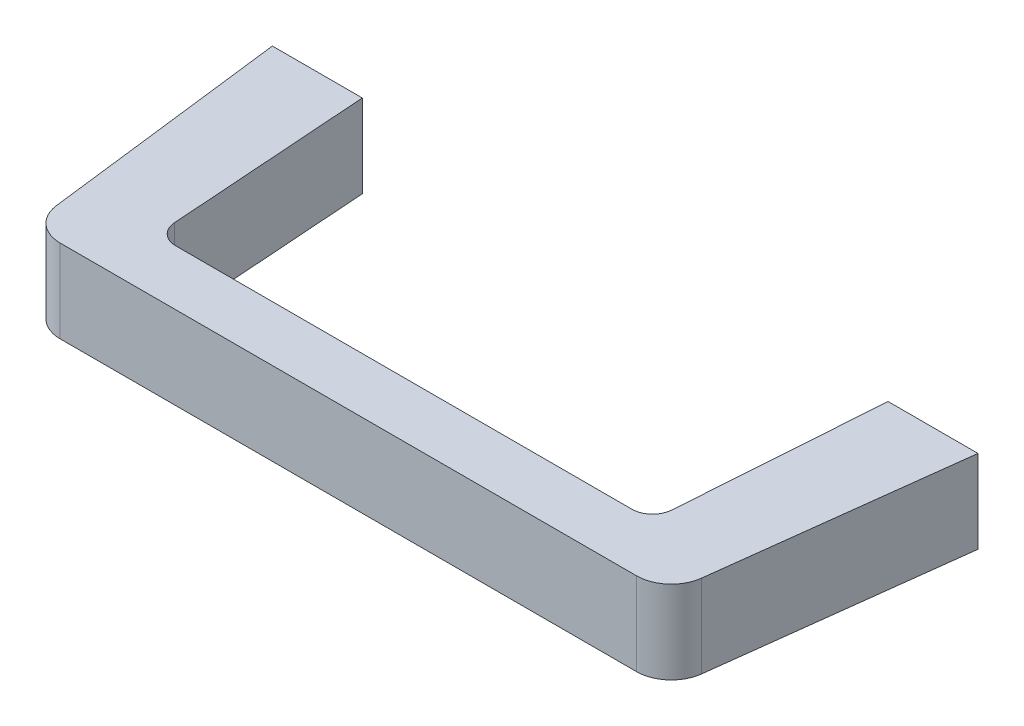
ISO-10303-21;
HEADER;
FILE_DESCRIPTION(('STEP AP214'),'2;1');
FILE_NAME('part.step','',(''),(''),'','','');
FILE_SCHEMA(('AUTOMOTIVE_DESIGN { 1 0 10303 214 1 1 1 1 }'));
ENDSEC;
DATA;
#1=APPLICATION_CONTEXT('core data for automotive mechanical design processes');
#2=APPLICATION_PROTOCOL_DEFINITION('international standard','automotive_design',2000,#1);
#3=PRODUCT_CONTEXT('',#1,'mechanical');
#4=PRODUCT('Part','Part','',(#3));
#5=PRODUCT_RELATED_PRODUCT_CATEGORY('part','',(#4));
#6=PRODUCT_DEFINITION_FORMATION('','',#4);
#7=PRODUCT_DEFINITION_CONTEXT('part definition',#1,'design');
#8=PRODUCT_DEFINITION('design','',#6,#7);
#9=PRODUCT_DEFINITION_SHAPE('','',#8);
#10=(LENGTH_UNIT() NAMED_UNIT(*) SI_UNIT(.MILLI.,.METRE.));
#11=(NAMED_UNIT(*) PLANE_ANGLE_UNIT() SI_UNIT($,.RADIAN.));
#12=(NAMED_UNIT(*) SI_UNIT($,.STERADIAN.) SOLID_ANGLE_UNIT());
#13=UNCERTAINTY_MEASURE_WITH_UNIT(LENGTH_MEASURE(1.E-05),#10,'distance_accuracy_value','');
#14=(GEOMETRIC_REPRESENTATION_CONTEXT(3) GLOBAL_UNCERTAINTY_ASSIGNED_CONTEXT((#13)) GLOBAL_UNIT_ASSIGNED_CONTEXT((#10,
#11,#12)) REPRESENTATION_CONTEXT('',''));
#15=CARTESIAN_POINT('',(0.,0.,0.));
#16=DIRECTION('',(0.,0.,1.));
#17=DIRECTION('',(1.,0.,0.));
#18=AXIS2_PLACEMENT_3D('',#15,#16,#17);
#19=CARTESIAN_POINT('',(-7.,-6.,0.));
#20=DIRECTION('',(0.,0.,1.));
#21=DIRECTION('',(0.,-1.,0.));
#22=AXIS2_PLACEMENT_3D('',#19,#20,#21);
#23=PLANE('',#22);
#24=DIRECTION('',(0.,1.,0.));
#25=VECTOR('',#24,1.);
#26=CARTESIAN_POINT('',(6.,-6.,0.));
#27=LINE('',#26,#25);
#28=CARTESIAN_POINT('',(6.,-6.,0.));
#29=VERTEX_POINT('',#28);
#30=CARTESIAN_POINT('',(6.,6.,0.));
#31=VERTEX_POINT('',#30);
#32=EDGE_CURVE('E196',#29,#31,#27,.T.);
#33=ORIENTED_EDGE('',*,*,#32,.F.);
#34=DIRECTION('',(1.,0.,0.));
#35=VECTOR('',#34,1.);
#36=CARTESIAN_POINT('',(-7.,-6.,0.));
#37=LINE('',#36,#35);
#38=CARTESIAN_POINT('',(-7.,-6.,0.));
#39=VERTEX_POINT('',#38);
#40=EDGE_CURVE('E162',#39,#29,#37,.T.);
#41=ORIENTED_EDGE('',*,*,#40,.F.);
#42=DIRECTION('',(0.,1.,0.));
#43=VECTOR('',#42,1.);
#44=CARTESIAN_POINT('',(-7.,-6.,0.));
#45=LINE('',#44,#43);
#46=CARTESIAN_POINT('',(-7.,6.,0.));
#47=VERTEX_POINT('',#46);
#48=EDGE_CURVE('E198',#39,#47,#45,.T.);
#49=ORIENTED_EDGE('',*,*,#48,.T.);
#50=DIRECTION('',(1.,0.,0.));
#51=VECTOR('',#50,1.);
#52=CARTESIAN_POINT('',(-7.,6.,0.));
#53=LINE('',#52,#51);
#54=EDGE_CURVE('E130',#47,#31,#53,.T.);
#55=ORIENTED_EDGE('',*,*,#54,.T.);
#56=EDGE_LOOP('',(#33,#41,#49,#55));
#57=FACE_BOUND('',#56,.T.);
#58=CARTESIAN_POINT('',(0.,0.,0.));
#59=DIRECTION('',(0.,0.,1.));
#60=DIRECTION('',(0.,-1.,0.));
#61=AXIS2_PLACEMENT_3D('',#58,#59,#60);
#62=CIRCLE('',#61,2.5);
#63=CARTESIAN_POINT('',(0.,-2.5,0.));
#64=VERTEX_POINT('',#63);
#65=EDGE_CURVE('E292',#64,#64,#62,.T.);
#66=ORIENTED_EDGE('',*,*,#65,.T.);
#67=EDGE_LOOP('',(#66));
#68=FACE_BOUND('',#67,.T.);
#69=ADVANCED_FACE('F14',(#57,#68),#23,.F.);
#70=CARTESIAN_POINT('',(85.664991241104,-6.,35.));
#71=DIRECTION('',(0.,1.,0.));
#72=DIRECTION('',(-1.,0.,0.));
#73=AXIS2_PLACEMENT_3D('',#70,#71,#72);
#74=CYLINDRICAL_SURFACE('',#73,5.);
#75=DIRECTION('',(0.,1.,0.));
#76=VECTOR('',#75,1.);
#77=CARTESIAN_POINT('',(85.664991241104,-6.,40.));
#78=LINE('',#77,#76);
#79=CARTESIAN_POINT('',(85.664991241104,-6.,40.));
#80=VERTEX_POINT('',#79);
#81=CARTESIAN_POINT('',(85.664991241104,6.,40.));
#82=VERTEX_POINT('',#81);
#83=EDGE_CURVE('E9',#80,#82,#78,.T.);
#84=ORIENTED_EDGE('',*,*,#83,.F.);
#85=CARTESIAN_POINT('',(85.664991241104,-6.,35.));
#86=DIRECTION('',(0.,-1.,0.));
#87=DIRECTION('',(1.,0.,0.));
#88=AXIS2_PLACEMENT_3D('',#85,#86,#87);
#89=CIRCLE('',#88,5.);
#90=CARTESIAN_POINT('',(90.627721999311,-6.,35.6093467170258));
#91=VERTEX_POINT('',#90);
#92=EDGE_CURVE('E153',#91,#80,#89,.T.);
#93=ORIENTED_EDGE('',*,*,#92,.F.);
#94=DIRECTION('',(0.,1.,0.));
#95=VECTOR('',#94,1.);
#96=CARTESIAN_POINT('',(90.627721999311,-6.,35.6093467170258));
#97=LINE('',#96,#95);
#98=CARTESIAN_POINT('',(90.627721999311,6.,35.6093467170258));
#99=VERTEX_POINT('',#98);
#100=EDGE_CURVE('E29',#91,#99,#97,.T.);
#101=ORIENTED_EDGE('',*,*,#100,.T.);
#102=CARTESIAN_POINT('',(85.664991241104,6.,35.));
#103=DIRECTION('',(0.,-1.,0.));
#104=DIRECTION('',(1.,0.,0.));
#105=AXIS2_PLACEMENT_3D('',#102,#103,#104);
#106=CIRCLE('',#105,5.);
#107=EDGE_CURVE('E113',#99,#82,#106,.T.);
#108=ORIENTED_EDGE('',*,*,#107,.T.);
#109=EDGE_LOOP('',(#84,#93,#101,#108));
#110=FACE_BOUND('',#109,.T.);
#111=ADVANCED_FACE('F114',(#110),#74,.T.);
#112=CARTESIAN_POINT('',(85.664991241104,-6.,40.));
#113=DIRECTION('',(0.,0.,-1.));
#114=DIRECTION('',(1.,0.,0.));
#115=AXIS2_PLACEMENT_3D('',#112,#113,#114);
#116=PLANE('',#115);
#117=DIRECTION('',(0.,1.,0.));
#118=VECTOR('',#117,1.);
#119=CARTESIAN_POINT('',(2.33500875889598,-6.,40.));
#120=LINE('',#119,#118);
#121=CARTESIAN_POINT('',(2.33500875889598,-6.,40.));
#122=VERTEX_POINT('',#121);
#123=CARTESIAN_POINT('',(2.33500875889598,6.,40.));
#124=VERTEX_POINT('',#123);
#125=EDGE_CURVE('E22',#122,#124,#120,.T.);
#126=ORIENTED_EDGE('',*,*,#125,.F.);
#127=DIRECTION('',(-1.,0.,0.));
#128=VECTOR('',#127,1.);
#129=CARTESIAN_POINT('',(85.664991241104,-6.,40.));
#130=LINE('',#129,#128);
#131=EDGE_CURVE('E109',#80,#122,#130,.T.);
#132=ORIENTED_EDGE('',*,*,#131,.F.);
#133=ORIENTED_EDGE('',*,*,#83,.T.);
#134=DIRECTION('',(-1.,0.,0.));
#135=VECTOR('',#134,1.);
#136=CARTESIAN_POINT('',(85.664991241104,6.,40.));
#137=LINE('',#136,#135);
#138=EDGE_CURVE('E106',#82,#124,#137,.T.);
#139=ORIENTED_EDGE('',*,*,#138,.T.);
#140=EDGE_LOOP('',(#126,#132,#133,#139));
#141=FACE_BOUND('',#140,.T.);
#142=ADVANCED_FACE('F16',(#141),#116,.F.);
#143=CARTESIAN_POINT('',(2.33500875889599,-6.,35.));
#144=DIRECTION('',(0.,1.,0.));
#145=DIRECTION('',(-1.,0.,0.));
#146=AXIS2_PLACEMENT_3D('',#143,#144,#145);
#147=CYLINDRICAL_SURFACE('',#146,5.);
#148=DIRECTION('',(0.,1.,0.));
#149=VECTOR('',#148,1.);
#150=CARTESIAN_POINT('',(-2.62772199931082,-6.,35.6093467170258));
#151=LINE('',#150,#149);
#152=CARTESIAN_POINT('',(-2.62772199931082,-6.,35.6093467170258));
#153=VERTEX_POINT('',#152);
#154=CARTESIAN_POINT('',(-2.62772199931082,6.,35.6093467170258));
#155=VERTEX_POINT('',#154);
#156=EDGE_CURVE('E200',#153,#155,#151,.T.);
#157=ORIENTED_EDGE('',*,*,#156,.F.);
#158=CARTESIAN_POINT('',(2.33500875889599,-6.,35.));
#159=DIRECTION('',(0.,-1.,0.));
#160=DIRECTION('',(1.,0.,0.));
#161=AXIS2_PLACEMENT_3D('',#158,#159,#160);
#162=CIRCLE('',#161,5.);
#163=EDGE_CURVE('E156',#122,#153,#162,.T.);
#164=ORIENTED_EDGE('',*,*,#163,.F.);
#165=ORIENTED_EDGE('',*,*,#125,.T.);
#166=CARTESIAN_POINT('',(2.33500875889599,6.,35.));
#167=DIRECTION('',(0.,-1.,0.));
#168=DIRECTION('',(1.,0.,0.));
#169=AXIS2_PLACEMENT_3D('',#166,#167,#168);
#170=CIRCLE('',#169,5.);
#171=EDGE_CURVE('E122',#124,#155,#170,.T.);
#172=ORIENTED_EDGE('',*,*,#171,.T.);
#173=EDGE_LOOP('',(#157,#164,#165,#172));
#174=FACE_BOUND('',#173,.T.);
#175=ADVANCED_FACE('F203',(#174),#147,.T.);
#176=CARTESIAN_POINT('',(-2.62772199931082,-6.,35.6093467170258));
#177=DIRECTION('',(0.992546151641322,0.,-0.121869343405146));
#178=DIRECTION('',(0.121869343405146,0.,0.992546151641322));
#179=AXIS2_PLACEMENT_3D('',#176,#177,#178);
#180=PLANE('',#179);
#181=ORIENTED_EDGE('',*,*,#48,.F.);
#182=DIRECTION('',(-0.121869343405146,0.,-0.992546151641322));
#183=VECTOR('',#182,1.);
#184=CARTESIAN_POINT('',(-2.62772199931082,-6.,35.6093467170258));
#185=LINE('',#184,#183);
#186=EDGE_CURVE('E159',#153,#39,#185,.T.);
#187=ORIENTED_EDGE('',*,*,#186,.F.);
#188=ORIENTED_EDGE('',*,*,#156,.T.);
#189=DIRECTION('',(-0.121869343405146,0.,-0.992546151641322));
#190=VECTOR('',#189,1.);
#191=CARTESIAN_POINT('',(-2.62772199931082,6.,35.6093467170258));
#192=LINE('',#191,#190);
#193=EDGE_CURVE('E124',#155,#47,#192,.T.);
#194=ORIENTED_EDGE('',*,*,#193,.T.);
#195=EDGE_LOOP('',(#181,#187,#188,#194));
#196=FACE_BOUND('',#195,.T.);
#197=ADVANCED_FACE('F235',(#196),#180,.F.);
#198=CARTESIAN_POINT('',(6.,-6.,0.));
#199=DIRECTION('',(-0.997564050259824,0.,0.0697564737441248));
#200=DIRECTION('',(-0.0697564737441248,0.,-0.997564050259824));
#201=AXIS2_PLACEMENT_3D('',#198,#199,#200);
#202=PLANE('',#201);
#203=DIRECTION('',(0.,1.,0.));
#204=VECTOR('',#203,1.);
#205=CARTESIAN_POINT('',(8.04251108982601,-6.,29.2092694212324));
#206=LINE('',#205,#204);
#207=CARTESIAN_POINT('',(8.04251108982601,-6.,29.2092694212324));
#208=VERTEX_POINT('',#207);
#209=CARTESIAN_POINT('',(8.04251108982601,6.,29.2092694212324));
#210=VERTEX_POINT('',#209);
#211=EDGE_CURVE('E194',#208,#210,#206,.T.);
#212=ORIENTED_EDGE('',*,*,#211,.F.);
#213=DIRECTION('',(0.0697564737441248,0.,0.997564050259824));
#214=VECTOR('',#213,1.);
#215=CARTESIAN_POINT('',(6.,-6.,0.));
#216=LINE('',#215,#214);
#217=EDGE_CURVE('E165',#29,#208,#216,.T.);
#218=ORIENTED_EDGE('',*,*,#217,.F.);
#219=ORIENTED_EDGE('',*,*,#32,.T.);
#220=DIRECTION('',(0.0697564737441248,0.,0.997564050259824));
#221=VECTOR('',#220,1.);
#222=CARTESIAN_POINT('',(6.,6.,0.));
#223=LINE('',#222,#221);
#224=EDGE_CURVE('E133',#31,#210,#223,.T.);
#225=ORIENTED_EDGE('',*,*,#224,.T.);
#226=EDGE_LOOP('',(#212,#218,#219,#225));
#227=FACE_BOUND('',#226,.T.);
#228=ADVANCED_FACE('F230',(#227),#202,.F.);
#229=CARTESIAN_POINT('',(11.0352032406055,-6.,29.));
#230=DIRECTION('',(0.,1.,0.));
#231=DIRECTION('',(-1.,0.,0.));
#232=AXIS2_PLACEMENT_3D('',#229,#230,#231);
#233=CYLINDRICAL_SURFACE('',#232,3.);
#234=DIRECTION('',(0.,1.,0.));
#235=VECTOR('',#234,1.);
#236=CARTESIAN_POINT('',(11.0352032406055,-6.,32.));
#237=LINE('',#236,#235);
#238=CARTESIAN_POINT('',(11.0352032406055,-6.,32.));
#239=VERTEX_POINT('',#238);
#240=CARTESIAN_POINT('',(11.0352032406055,6.,32.));
#241=VERTEX_POINT('',#240);
#242=EDGE_CURVE('E192',#239,#241,#237,.T.);
#243=ORIENTED_EDGE('',*,*,#242,.F.);
#244=CARTESIAN_POINT('',(11.0352032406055,-6.,29.));
#245=DIRECTION('',(0.,-1.,0.));
#246=DIRECTION('',(1.,0.,0.));
#247=AXIS2_PLACEMENT_3D('',#244,#245,#246);
#248=CIRCLE('',#247,3.);
#249=EDGE_CURVE('E168',#239,#208,#248,.T.);
#250=ORIENTED_EDGE('',*,*,#249,.T.);
#251=ORIENTED_EDGE('',*,*,#211,.T.);
#252=CARTESIAN_POINT('',(11.0352032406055,6.,29.));
#253=DIRECTION('',(0.,-1.,0.));
#254=DIRECTION('',(1.,0.,0.));
#255=AXIS2_PLACEMENT_3D('',#252,#253,#254);
#256=CIRCLE('',#255,3.);
#257=EDGE_CURVE('E136',#241,#210,#256,.T.);
#258=ORIENTED_EDGE('',*,*,#257,.F.);
#259=EDGE_LOOP('',(#243,#250,#251,#258));
#260=FACE_BOUND('',#259,.T.);
#261=ADVANCED_FACE('F226',(#260),#233,.F.);
#262=CARTESIAN_POINT('',(11.0352032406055,-6.,32.));
#263=DIRECTION('',(0.,0.,1.));
#264=DIRECTION('',(0.,-1.,0.));
#265=AXIS2_PLACEMENT_3D('',#262,#263,#264);
#266=PLANE('',#265);
#267=DIRECTION('',(0.,1.,0.));
#268=VECTOR('',#267,1.);
#269=CARTESIAN_POINT('',(76.9647967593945,-6.,32.));
#270=LINE('',#269,#268);
#271=CARTESIAN_POINT('',(76.9647967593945,-6.,32.));
#272=VERTEX_POINT('',#271);
#273=CARTESIAN_POINT('',(76.9647967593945,6.,32.));
#274=VERTEX_POINT('',#273);
#275=EDGE_CURVE('E190',#272,#274,#270,.T.);
#276=ORIENTED_EDGE('',*,*,#275,.F.);
#277=DIRECTION('',(1.,0.,0.));
#278=VECTOR('',#277,1.);
#279=CARTESIAN_POINT('',(11.0352032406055,-6.,32.));
#280=LINE('',#279,#278);
#281=EDGE_CURVE('E171',#239,#272,#280,.T.);
#282=ORIENTED_EDGE('',*,*,#281,.F.);
#283=ORIENTED_EDGE('',*,*,#242,.T.);
#284=DIRECTION('',(1.,0.,0.));
#285=VECTOR('',#284,1.);
#286=CARTESIAN_POINT('',(11.0352032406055,6.,32.));
#287=LINE('',#286,#285);
#288=EDGE_CURVE('E139',#241,#274,#287,.T.);
#289=ORIENTED_EDGE('',*,*,#288,.T.);
#290=EDGE_LOOP('',(#276,#282,#283,#289));
#291=FACE_BOUND('',#290,.T.);
#292=ADVANCED_FACE('F221',(#291),#266,.F.);
#293=CARTESIAN_POINT('',(76.9647967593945,-6.,29.));
#294=DIRECTION('',(0.,1.,0.));
#295=DIRECTION('',(-1.,0.,0.));
#296=AXIS2_PLACEMENT_3D('',#293,#294,#295);
#297=CYLINDRICAL_SURFACE('',#296,3.);
#298=DIRECTION('',(0.,1.,0.));
#299=VECTOR('',#298,1.);
#300=CARTESIAN_POINT('',(79.957488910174,-6.,29.2092694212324));
#301=LINE('',#300,#299);
#302=CARTESIAN_POINT('',(79.957488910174,-6.,29.2092694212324));
#303=VERTEX_POINT('',#302);
#304=CARTESIAN_POINT('',(79.957488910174,6.,29.2092694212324));
#305=VERTEX_POINT('',#304);
#306=EDGE_CURVE('E188',#303,#305,#301,.T.);
#307=ORIENTED_EDGE('',*,*,#306,.F.);
#308=CARTESIAN_POINT('',(76.9647967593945,-6.,29.));
#309=DIRECTION('',(0.,-1.,0.));
#310=DIRECTION('',(1.,0.,0.));
#311=AXIS2_PLACEMENT_3D('',#308,#309,#310);
#312=CIRCLE('',#311,3.);
#313=EDGE_CURVE('E174',#303,#272,#312,.T.);
#314=ORIENTED_EDGE('',*,*,#313,.T.);
#315=ORIENTED_EDGE('',*,*,#275,.T.);
#316=CARTESIAN_POINT('',(76.9647967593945,6.,29.));
#317=DIRECTION('',(0.,-1.,0.));
#318=DIRECTION('',(1.,0.,0.));
#319=AXIS2_PLACEMENT_3D('',#316,#317,#318);
#320=CIRCLE('',#319,3.);
#321=EDGE_CURVE('E142',#305,#274,#320,.T.);
#322=ORIENTED_EDGE('',*,*,#321,.F.);
#323=EDGE_LOOP('',(#307,#314,#315,#322));
#324=FACE_BOUND('',#323,.T.);
#325=ADVANCED_FACE('F218',(#324),#297,.F.);
#326=CARTESIAN_POINT('',(82.,-6.,0.));
#327=DIRECTION('',(-0.997564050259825,0.,-0.0697564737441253));
#328=DIRECTION('',(0.0697564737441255,0.,-0.997564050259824));
#329=AXIS2_PLACEMENT_3D('',#326,#327,#328);
#330=PLANE('',#329);
#331=DIRECTION('',(0.,1.,0.));
#332=VECTOR('',#331,1.);
#333=CARTESIAN_POINT('',(82.,-6.,0.));
#334=LINE('',#333,#332);
#335=CARTESIAN_POINT('',(82.,-6.,0.));
#336=VERTEX_POINT('',#335);
#337=CARTESIAN_POINT('',(82.,6.,0.));
#338=VERTEX_POINT('',#337);
#339=EDGE_CURVE('E186',#336,#338,#334,.T.);
#340=ORIENTED_EDGE('',*,*,#339,.F.);
#341=DIRECTION('',(-0.0697564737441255,0.,0.997564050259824));
#342=VECTOR('',#341,1.);
#343=CARTESIAN_POINT('',(82.,-6.,0.));
#344=LINE('',#343,#342);
#345=EDGE_CURVE('E177',#336,#303,#344,.T.);
#346=ORIENTED_EDGE('',*,*,#345,.T.);
#347=ORIENTED_EDGE('',*,*,#306,.T.);
#348=DIRECTION('',(-0.0697564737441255,0.,0.997564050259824));
#349=VECTOR('',#348,1.);
#350=CARTESIAN_POINT('',(82.,6.,0.));
#351=LINE('',#350,#349);
#352=EDGE_CURVE('E145',#338,#305,#351,.T.);
#353=ORIENTED_EDGE('',*,*,#352,.F.);
#354=EDGE_LOOP('',(#340,#346,#347,#353));
#355=FACE_BOUND('',#354,.T.);
#356=ADVANCED_FACE('F215',(#355),#330,.T.);
#357=CARTESIAN_POINT('',(95.,-6.,0.));
#358=DIRECTION('',(0.,0.,-1.));
#359=DIRECTION('',(0.,1.,0.));
#360=AXIS2_PLACEMENT_3D('',#357,#358,#359);
#361=PLANE('',#360);
#362=CARTESIAN_POINT('',(88.,0.,0.));
#363=DIRECTION('',(0.,0.,-1.));
#364=DIRECTION('',(0.,1.,0.));
#365=AXIS2_PLACEMENT_3D('',#362,#363,#364);
#366=CIRCLE('',#365,2.5);
#367=CARTESIAN_POINT('',(88.,2.5,0.));
#368=VERTEX_POINT('',#367);
#369=EDGE_CURVE('E291',#368,#368,#366,.T.);
#370=ORIENTED_EDGE('',*,*,#369,.F.);
#371=EDGE_LOOP('',(#370));
#372=FACE_BOUND('',#371,.T.);
#373=DIRECTION('',(0.,1.,0.));
#374=VECTOR('',#373,1.);
#375=CARTESIAN_POINT('',(95.,-6.,0.));
#376=LINE('',#375,#374);
#377=CARTESIAN_POINT('',(95.,-6.,0.));
#378=VERTEX_POINT('',#377);
#379=CARTESIAN_POINT('',(95.,6.,0.));
#380=VERTEX_POINT('',#379);
#381=EDGE_CURVE('E37',#378,#380,#376,.T.);
#382=ORIENTED_EDGE('',*,*,#381,.F.);
#383=DIRECTION('',(-1.,0.,0.));
#384=VECTOR('',#383,1.);
#385=CARTESIAN_POINT('',(95.,-6.,0.));
#386=LINE('',#385,#384);
#387=EDGE_CURVE('E180',#378,#336,#386,.T.);
#388=ORIENTED_EDGE('',*,*,#387,.T.);
#389=ORIENTED_EDGE('',*,*,#339,.T.);
#390=DIRECTION('',(-1.,0.,0.));
#391=VECTOR('',#390,1.);
#392=CARTESIAN_POINT('',(95.,6.,0.));
#393=LINE('',#392,#391);
#394=EDGE_CURVE('E148',#380,#338,#393,.T.);
#395=ORIENTED_EDGE('',*,*,#394,.F.);
#396=EDGE_LOOP('',(#382,#388,#389,#395));
#397=FACE_BOUND('',#396,.T.);
#398=ADVANCED_FACE('F210',(#372,#397),#361,.T.);
#399=CARTESIAN_POINT('',(90.627721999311,-6.,35.6093467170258));
#400=DIRECTION('',(0.992546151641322,0.,0.121869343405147));
#401=DIRECTION('',(-0.121869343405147,0.,0.992546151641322));
#402=AXIS2_PLACEMENT_3D('',#399,#400,#401);
#403=PLANE('',#402);
#404=DIRECTION('',(0.121869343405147,0.,-0.992546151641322));
#405=VECTOR('',#404,1.);
#406=CARTESIAN_POINT('',(90.627721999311,-6.,35.6093467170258));
#407=LINE('',#406,#405);
#408=EDGE_CURVE('E182',#91,#378,#407,.T.);
#409=ORIENTED_EDGE('',*,*,#408,.T.);
#410=ORIENTED_EDGE('',*,*,#381,.T.);
#411=DIRECTION('',(0.121869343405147,0.,-0.992546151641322));
#412=VECTOR('',#411,1.);
#413=CARTESIAN_POINT('',(90.627721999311,6.,35.6093467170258));
#414=LINE('',#413,#412);
#415=EDGE_CURVE('E151',#99,#380,#414,.T.);
#416=ORIENTED_EDGE('',*,*,#415,.F.);
#417=ORIENTED_EDGE('',*,*,#100,.F.);
#418=EDGE_LOOP('',(#409,#410,#416,#417));
#419=FACE_BOUND('',#418,.T.);
#420=ADVANCED_FACE('F209',(#419),#403,.T.);
#421=CARTESIAN_POINT('',(85.664991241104,-6.,35.));
#422=DIRECTION('',(0.,-1.,0.));
#423=DIRECTION('',(1.,0.,0.));
#424=AXIS2_PLACEMENT_3D('',#421,#422,#423);
#425=PLANE('',#424);
#426=ORIENTED_EDGE('',*,*,#92,.T.);
#427=ORIENTED_EDGE('',*,*,#131,.T.);
#428=ORIENTED_EDGE('',*,*,#163,.T.);
#429=ORIENTED_EDGE('',*,*,#186,.T.);
#430=ORIENTED_EDGE('',*,*,#40,.T.);
#431=ORIENTED_EDGE('',*,*,#217,.T.);
#432=ORIENTED_EDGE('',*,*,#249,.F.);
#433=ORIENTED_EDGE('',*,*,#281,.T.);
#434=ORIENTED_EDGE('',*,*,#313,.F.);
#435=ORIENTED_EDGE('',*,*,#345,.F.);
#436=ORIENTED_EDGE('',*,*,#387,.F.);
#437=ORIENTED_EDGE('',*,*,#408,.F.);
#438=EDGE_LOOP('',(#426,#427,#428,#429,#430,#431,#432,#433,#434,#435,#436,#437));
#439=FACE_BOUND('',#438,.T.);
#440=ADVANCED_FACE('F205',(#439),#425,.T.);
#441=CARTESIAN_POINT('',(85.664991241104,6.,35.));
#442=DIRECTION('',(0.,-1.,0.));
#443=DIRECTION('',(1.,0.,0.));
#444=AXIS2_PLACEMENT_3D('',#441,#442,#443);
#445=PLANE('',#444);
#446=ORIENTED_EDGE('',*,*,#107,.F.);
#447=ORIENTED_EDGE('',*,*,#415,.T.);
#448=ORIENTED_EDGE('',*,*,#394,.T.);
#449=ORIENTED_EDGE('',*,*,#352,.T.);
#450=ORIENTED_EDGE('',*,*,#321,.T.);
#451=ORIENTED_EDGE('',*,*,#288,.F.);
#452=ORIENTED_EDGE('',*,*,#257,.T.);
#453=ORIENTED_EDGE('',*,*,#224,.F.);
#454=ORIENTED_EDGE('',*,*,#54,.F.);
#455=ORIENTED_EDGE('',*,*,#193,.F.);
#456=ORIENTED_EDGE('',*,*,#171,.F.);
#457=ORIENTED_EDGE('',*,*,#138,.F.);
#458=EDGE_LOOP('',(#446,#447,#448,#449,#450,#451,#452,#453,#454,#455,#456,#457));
#459=FACE_BOUND('',#458,.T.);
#460=ADVANCED_FACE('F119',(#459),#445,.F.);
#461=CARTESIAN_POINT('',(88.,0.,10.));
#462=DIRECTION('',(0.,0.,-1.));
#463=DIRECTION('',(0.,1.,0.));
#464=AXIS2_PLACEMENT_3D('',#461,#462,#463);
#465=CYLINDRICAL_SURFACE('',#464,2.5);
#466=CARTESIAN_POINT('',(88.,0.,10.));
#467=DIRECTION('',(0.,0.,-1.));
#468=DIRECTION('',(0.,1.,0.));
#469=AXIS2_PLACEMENT_3D('',#466,#467,#468);
#470=CIRCLE('',#469,2.5);
#471=CARTESIAN_POINT('',(88.,2.5,10.));
#472=VERTEX_POINT('',#471);
#473=EDGE_CURVE('E117',#472,#472,#470,.T.);
#474=ORIENTED_EDGE('',*,*,#473,.F.);
#475=EDGE_LOOP('',(#474));
#476=FACE_BOUND('',#475,.T.);
#477=ORIENTED_EDGE('',*,*,#369,.T.);
#478=EDGE_LOOP('',(#477));
#479=FACE_BOUND('',#478,.T.);
#480=ADVANCED_FACE('F270',(#476,#479),#465,.F.);
#481=CARTESIAN_POINT('',(88.,0.,10.));
#482=DIRECTION('',(0.,0.,-1.));
#483=DIRECTION('',(0.,1.,0.));
#484=AXIS2_PLACEMENT_3D('',#481,#482,#483);
#485=PLANE('',#484);
#486=ORIENTED_EDGE('',*,*,#473,.T.);
#487=EDGE_LOOP('',(#486));
#488=FACE_BOUND('',#487,.T.);
#489=ADVANCED_FACE('F271',(#488),#485,.T.);
#490=CARTESIAN_POINT('',(0.,0.,10.));
#491=DIRECTION('',(0.,0.,-1.));
#492=DIRECTION('',(0.,1.,0.));
#493=AXIS2_PLACEMENT_3D('',#490,#491,#492);
#494=CYLINDRICAL_SURFACE('',#493,2.5);
#495=CARTESIAN_POINT('',(0.,0.,10.));
#496=DIRECTION('',(0.,0.,1.));
#497=DIRECTION('',(0.,-1.,0.));
#498=AXIS2_PLACEMENT_3D('',#495,#496,#497);
#499=CIRCLE('',#498,2.5);
#500=CARTESIAN_POINT('',(0.,-2.5,10.));
#501=VERTEX_POINT('',#500);
#502=EDGE_CURVE('E290',#501,#501,#499,.T.);
#503=ORIENTED_EDGE('',*,*,#502,.T.);
#504=EDGE_LOOP('',(#503));
#505=FACE_BOUND('',#504,.T.);
#506=ORIENTED_EDGE('',*,*,#65,.F.);
#507=EDGE_LOOP('',(#506));
#508=FACE_BOUND('',#507,.T.);
#509=ADVANCED_FACE('F278',(#505,#508),#494,.F.);
#510=CARTESIAN_POINT('',(0.,0.,10.));
#511=DIRECTION('',(0.,0.,1.));
#512=DIRECTION('',(0.,-1.,0.));
#513=AXIS2_PLACEMENT_3D('',#510,#511,#512);
#514=PLANE('',#513);
#515=ORIENTED_EDGE('',*,*,#502,.F.);
#516=EDGE_LOOP('',(#515));
#517=FACE_BOUND('',#516,.T.);
#518=ADVANCED_FACE('F275',(#517),#514,.F.);
#519=CLOSED_SHELL('',(#69,#111,#142,#175,#197,#228,#261,#292,#325,#356,#398,#420,#440,#460,#480,
#489,#509,#518));
#520=MANIFOLD_SOLID_BREP('B1',#519);
#521=ADVANCED_BREP_SHAPE_REPRESENTATION('',(#18,#520),#14);
#522=SHAPE_DEFINITION_REPRESENTATION(#9,#521);
ENDSEC;
END-ISO-10303-21;
